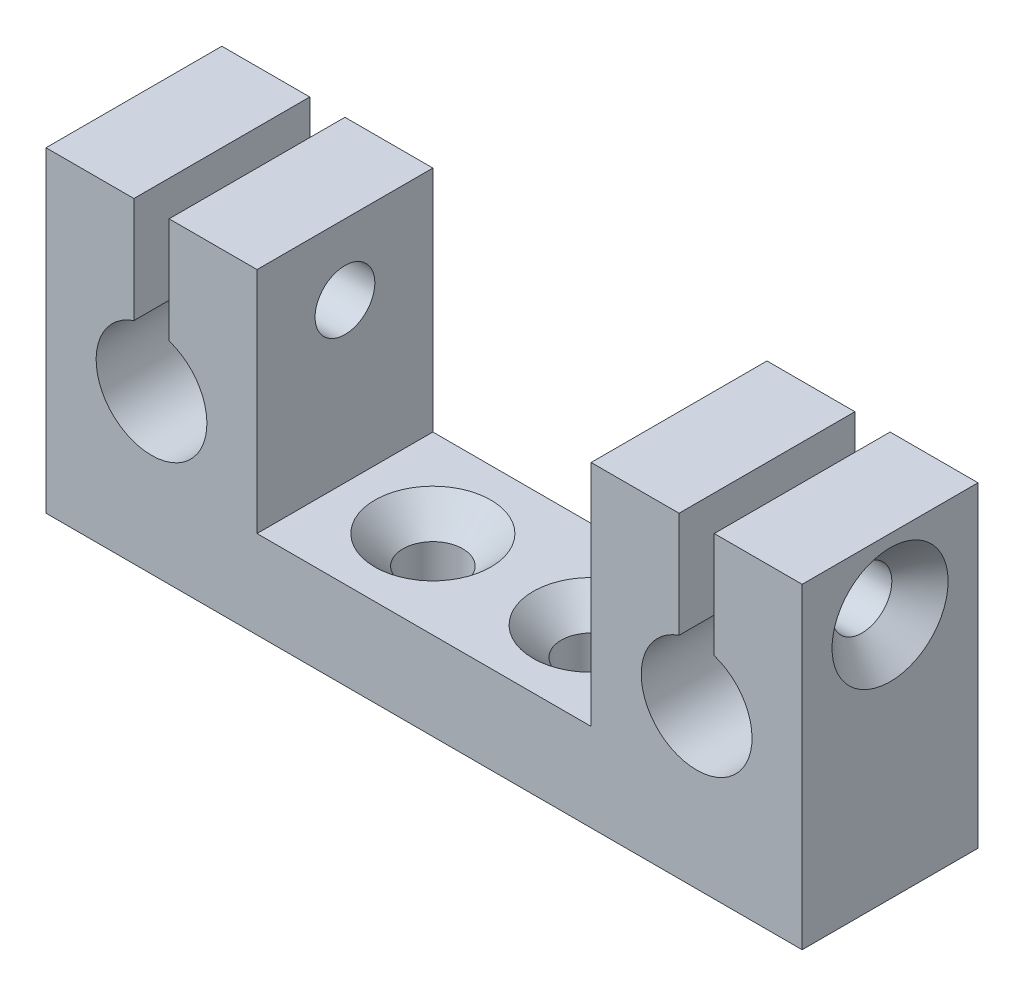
ISO-10303-21;
HEADER;
FILE_DESCRIPTION(('STEP AP214'),'2;1');
FILE_NAME('part.step','',(''),(''),'','','');
FILE_SCHEMA(('AUTOMOTIVE_DESIGN { 1 0 10303 214 1 1 1 1 }'));
ENDSEC;
DATA;
#1=APPLICATION_CONTEXT('core data for automotive mechanical design processes');
#2=APPLICATION_PROTOCOL_DEFINITION('international standard','automotive_design',2000,#1);
#3=PRODUCT_CONTEXT('',#1,'mechanical');
#4=PRODUCT('Part','Part','',(#3));
#5=PRODUCT_RELATED_PRODUCT_CATEGORY('part','',(#4));
#6=PRODUCT_DEFINITION_FORMATION('','',#4);
#7=PRODUCT_DEFINITION_CONTEXT('part definition',#1,'design');
#8=PRODUCT_DEFINITION('design','',#6,#7);
#9=PRODUCT_DEFINITION_SHAPE('','',#8);
#10=(LENGTH_UNIT() NAMED_UNIT(*) SI_UNIT(.MILLI.,.METRE.));
#11=(NAMED_UNIT(*) PLANE_ANGLE_UNIT() SI_UNIT($,.RADIAN.));
#12=(NAMED_UNIT(*) SI_UNIT($,.STERADIAN.) SOLID_ANGLE_UNIT());
#13=UNCERTAINTY_MEASURE_WITH_UNIT(LENGTH_MEASURE(1.E-05),#10,'distance_accuracy_value','');
#14=(GEOMETRIC_REPRESENTATION_CONTEXT(3) GLOBAL_UNCERTAINTY_ASSIGNED_CONTEXT((#13)) GLOBAL_UNIT_ASSIGNED_CONTEXT((#10,
#11,#12)) REPRESENTATION_CONTEXT('',''));
#15=CARTESIAN_POINT('',(0.,0.,0.));
#16=DIRECTION('',(0.,0.,1.));
#17=DIRECTION('',(1.,0.,0.));
#18=AXIS2_PLACEMENT_3D('',#15,#16,#17);
#19=CARTESIAN_POINT('',(0.,-2.5,10.));
#20=DIRECTION('',(0.,1.,0.));
#21=DIRECTION('',(0.,0.,1.));
#22=AXIS2_PLACEMENT_3D('',#19,#20,#21);
#23=PLANE('',#22);
#24=CARTESIAN_POINT('',(-4.49999999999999,-2.5,5.));
#25=DIRECTION('',(0.,1.,0.));
#26=DIRECTION('',(0.,0.,1.));
#27=AXIS2_PLACEMENT_3D('',#24,#25,#26);
#28=CIRCLE('',#27,1.7);
#29=CARTESIAN_POINT('',(-4.49999999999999,-2.5,6.7));
#30=VERTEX_POINT('',#29);
#31=EDGE_CURVE('E49',#30,#30,#28,.T.);
#32=ORIENTED_EDGE('',*,*,#31,.T.);
#33=EDGE_LOOP('',(#32));
#34=FACE_BOUND('',#33,.T.);
#35=CARTESIAN_POINT('',(4.5,-2.5,5.));
#36=DIRECTION('',(0.,1.,0.));
#37=DIRECTION('',(0.,0.,1.));
#38=AXIS2_PLACEMENT_3D('',#35,#36,#37);
#39=CIRCLE('',#38,1.7);
#40=CARTESIAN_POINT('',(4.5,-2.5,6.7));
#41=VERTEX_POINT('',#40);
#42=EDGE_CURVE('E226',#41,#41,#39,.T.);
#43=ORIENTED_EDGE('',*,*,#42,.T.);
#44=EDGE_LOOP('',(#43));
#45=FACE_BOUND('',#44,.T.);
#46=DIRECTION('',(0.,0.,-1.));
#47=VECTOR('',#46,1.);
#48=CARTESIAN_POINT('',(21.5,-2.5,10.));
#49=LINE('',#48,#47);
#50=CARTESIAN_POINT('',(21.5,-2.5,10.));
#51=VERTEX_POINT('',#50);
#52=CARTESIAN_POINT('',(21.5,-2.5,0.));
#53=VERTEX_POINT('',#52);
#54=EDGE_CURVE('E172',#51,#53,#49,.T.);
#55=ORIENTED_EDGE('',*,*,#54,.F.);
#56=DIRECTION('',(1.,0.,0.));
#57=VECTOR('',#56,1.);
#58=CARTESIAN_POINT('',(0.,-2.5,10.));
#59=LINE('',#58,#57);
#60=CARTESIAN_POINT('',(-21.5,-2.5,10.));
#61=VERTEX_POINT('',#60);
#62=EDGE_CURVE('E307',#61,#51,#59,.T.);
#63=ORIENTED_EDGE('',*,*,#62,.F.);
#64=DIRECTION('',(0.,0.,1.));
#65=VECTOR('',#64,1.);
#66=CARTESIAN_POINT('',(-21.5,-2.5,0.));
#67=LINE('',#66,#65);
#68=CARTESIAN_POINT('',(-21.5,-2.5,0.));
#69=VERTEX_POINT('',#68);
#70=EDGE_CURVE('E179',#69,#61,#67,.T.);
#71=ORIENTED_EDGE('',*,*,#70,.F.);
#72=DIRECTION('',(1.,0.,0.));
#73=VECTOR('',#72,1.);
#74=CARTESIAN_POINT('',(0.,-2.5,0.));
#75=LINE('',#74,#73);
#76=EDGE_CURVE('E164',#69,#53,#75,.T.);
#77=ORIENTED_EDGE('',*,*,#76,.T.);
#78=EDGE_LOOP('',(#55,#63,#71,#77));
#79=FACE_BOUND('',#78,.T.);
#80=ADVANCED_FACE('F45',(#34,#45,#79),#23,.F.);
#81=CARTESIAN_POINT('',(0.,0.,10.));
#82=DIRECTION('',(0.,0.,1.));
#83=DIRECTION('',(1.,0.,0.));
#84=AXIS2_PLACEMENT_3D('',#81,#82,#83);
#85=PLANE('',#84);
#86=ORIENTED_EDGE('',*,*,#62,.T.);
#87=DIRECTION('',(0.,-1.,0.));
#88=VECTOR('',#87,1.);
#89=CARTESIAN_POINT('',(21.5,0.,10.));
#90=LINE('',#89,#88);
#91=CARTESIAN_POINT('',(21.5,15.5,10.));
#92=VERTEX_POINT('',#91);
#93=EDGE_CURVE('E175',#92,#51,#90,.T.);
#94=ORIENTED_EDGE('',*,*,#93,.F.);
#95=DIRECTION('',(1.,0.,0.));
#96=VECTOR('',#95,1.);
#97=CARTESIAN_POINT('',(0.,15.5,10.));
#98=LINE('',#97,#96);
#99=CARTESIAN_POINT('',(16.5,15.5,10.));
#100=VERTEX_POINT('',#99);
#101=EDGE_CURVE('E313',#100,#92,#98,.T.);
#102=ORIENTED_EDGE('',*,*,#101,.F.);
#103=DIRECTION('',(0.,1.,0.));
#104=VECTOR('',#103,1.);
#105=CARTESIAN_POINT('',(16.5,17.5112149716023,10.));
#106=LINE('',#105,#104);
#107=CARTESIAN_POINT('',(16.5,9.48705540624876,10.));
#108=VERTEX_POINT('',#107);
#109=EDGE_CURVE('E271',#108,#100,#106,.T.);
#110=ORIENTED_EDGE('',*,*,#109,.F.);
#111=CARTESIAN_POINT('',(15.5,6.5,10.));
#112=DIRECTION('',(0.,0.,1.));
#113=DIRECTION('',(1.,0.,0.));
#114=AXIS2_PLACEMENT_3D('',#111,#112,#113);
#115=CIRCLE('',#114,3.14999999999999);
#116=CARTESIAN_POINT('',(14.5,9.48705540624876,10.));
#117=VERTEX_POINT('',#116);
#118=EDGE_CURVE('E293',#117,#108,#115,.T.);
#119=ORIENTED_EDGE('',*,*,#118,.F.);
#120=DIRECTION('',(0.,-1.,0.));
#121=VECTOR('',#120,1.);
#122=CARTESIAN_POINT('',(14.5,17.5112149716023,10.));
#123=LINE('',#122,#121);
#124=CARTESIAN_POINT('',(14.5,15.5,10.));
#125=VERTEX_POINT('',#124);
#126=EDGE_CURVE('E62',#125,#117,#123,.T.);
#127=ORIENTED_EDGE('',*,*,#126,.F.);
#128=CARTESIAN_POINT('',(9.5,15.5,10.));
#129=VERTEX_POINT('',#128);
#130=EDGE_CURVE('E314',#129,#125,#98,.T.);
#131=ORIENTED_EDGE('',*,*,#130,.F.);
#132=DIRECTION('',(0.,-1.,0.));
#133=VECTOR('',#132,1.);
#134=CARTESIAN_POINT('',(9.5,0.,10.));
#135=LINE('',#134,#133);
#136=CARTESIAN_POINT('',(9.5,2.5,10.));
#137=VERTEX_POINT('',#136);
#138=EDGE_CURVE('E310',#129,#137,#135,.T.);
#139=ORIENTED_EDGE('',*,*,#138,.T.);
#140=DIRECTION('',(1.,0.,0.));
#141=VECTOR('',#140,1.);
#142=CARTESIAN_POINT('',(0.,2.5,10.));
#143=LINE('',#142,#141);
#144=CARTESIAN_POINT('',(-9.49999999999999,2.5,10.));
#145=VERTEX_POINT('',#144);
#146=EDGE_CURVE('E199',#145,#137,#143,.T.);
#147=ORIENTED_EDGE('',*,*,#146,.F.);
#148=DIRECTION('',(0.,-1.,0.));
#149=VECTOR('',#148,1.);
#150=CARTESIAN_POINT('',(-9.49999999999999,0.,10.));
#151=LINE('',#150,#149);
#152=CARTESIAN_POINT('',(-9.49999999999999,15.5,10.));
#153=VERTEX_POINT('',#152);
#154=EDGE_CURVE('E298',#153,#145,#151,.T.);
#155=ORIENTED_EDGE('',*,*,#154,.F.);
#156=DIRECTION('',(1.,0.,0.));
#157=VECTOR('',#156,1.);
#158=CARTESIAN_POINT('',(0.,15.5,10.));
#159=LINE('',#158,#157);
#160=CARTESIAN_POINT('',(-14.5,15.5,10.));
#161=VERTEX_POINT('',#160);
#162=EDGE_CURVE('E301',#161,#153,#159,.T.);
#163=ORIENTED_EDGE('',*,*,#162,.F.);
#164=DIRECTION('',(0.,1.,0.));
#165=VECTOR('',#164,1.);
#166=CARTESIAN_POINT('',(-14.5,16.9536585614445,10.));
#167=LINE('',#166,#165);
#168=CARTESIAN_POINT('',(-14.5,9.48705540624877,10.));
#169=VERTEX_POINT('',#168);
#170=EDGE_CURVE('E264',#169,#161,#167,.T.);
#171=ORIENTED_EDGE('',*,*,#170,.F.);
#172=CARTESIAN_POINT('',(-15.5,6.50000000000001,10.));
#173=DIRECTION('',(0.,0.,1.));
#174=DIRECTION('',(1.,0.,0.));
#175=AXIS2_PLACEMENT_3D('',#172,#173,#174);
#176=CIRCLE('',#175,3.15);
#177=CARTESIAN_POINT('',(-16.5,9.48705540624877,10.));
#178=VERTEX_POINT('',#177);
#179=EDGE_CURVE('E290',#178,#169,#176,.T.);
#180=ORIENTED_EDGE('',*,*,#179,.F.);
#181=DIRECTION('',(0.,-1.,0.));
#182=VECTOR('',#181,1.);
#183=CARTESIAN_POINT('',(-16.5,16.9536585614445,10.));
#184=LINE('',#183,#182);
#185=CARTESIAN_POINT('',(-16.5,15.5,10.));
#186=VERTEX_POINT('',#185);
#187=EDGE_CURVE('E268',#186,#178,#184,.T.);
#188=ORIENTED_EDGE('',*,*,#187,.F.);
#189=CARTESIAN_POINT('',(-21.5,15.5,10.));
#190=VERTEX_POINT('',#189);
#191=EDGE_CURVE('E302',#190,#186,#159,.T.);
#192=ORIENTED_EDGE('',*,*,#191,.F.);
#193=DIRECTION('',(0.,-1.,0.));
#194=VECTOR('',#193,1.);
#195=CARTESIAN_POINT('',(-21.5,0.,10.));
#196=LINE('',#195,#194);
#197=EDGE_CURVE('E305',#190,#61,#196,.T.);
#198=ORIENTED_EDGE('',*,*,#197,.T.);
#199=EDGE_LOOP('',(#86,#94,#102,#110,#119,#127,#131,#139,#147,#155,#163,#171,#180,#188,#192,#198));
#200=FACE_BOUND('',#199,.T.);
#201=ADVANCED_FACE('F349',(#200),#85,.T.);
#202=CARTESIAN_POINT('',(0.,0.,0.));
#203=DIRECTION('',(0.,0.,1.));
#204=DIRECTION('',(1.,0.,0.));
#205=AXIS2_PLACEMENT_3D('',#202,#203,#204);
#206=PLANE('',#205);
#207=DIRECTION('',(0.,-1.,0.));
#208=VECTOR('',#207,1.);
#209=CARTESIAN_POINT('',(21.5,0.,0.));
#210=LINE('',#209,#208);
#211=CARTESIAN_POINT('',(21.5,15.5,0.));
#212=VERTEX_POINT('',#211);
#213=EDGE_CURVE('E159',#212,#53,#210,.T.);
#214=ORIENTED_EDGE('',*,*,#213,.T.);
#215=ORIENTED_EDGE('',*,*,#76,.F.);
#216=DIRECTION('',(0.,-1.,0.));
#217=VECTOR('',#216,1.);
#218=CARTESIAN_POINT('',(-21.5,0.,0.));
#219=LINE('',#218,#217);
#220=CARTESIAN_POINT('',(-21.5,15.5,0.));
#221=VERTEX_POINT('',#220);
#222=EDGE_CURVE('E183',#221,#69,#219,.T.);
#223=ORIENTED_EDGE('',*,*,#222,.F.);
#224=DIRECTION('',(1.,0.,0.));
#225=VECTOR('',#224,1.);
#226=CARTESIAN_POINT('',(0.,15.5,0.));
#227=LINE('',#226,#225);
#228=CARTESIAN_POINT('',(-16.5,15.5,0.));
#229=VERTEX_POINT('',#228);
#230=EDGE_CURVE('E185',#221,#229,#227,.T.);
#231=ORIENTED_EDGE('',*,*,#230,.T.);
#232=DIRECTION('',(0.,-1.,0.));
#233=VECTOR('',#232,1.);
#234=CARTESIAN_POINT('',(-16.5,16.9536585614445,0.));
#235=LINE('',#234,#233);
#236=CARTESIAN_POINT('',(-16.5,9.48705540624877,0.));
#237=VERTEX_POINT('',#236);
#238=EDGE_CURVE('E260',#229,#237,#235,.T.);
#239=ORIENTED_EDGE('',*,*,#238,.T.);
#240=CARTESIAN_POINT('',(-15.5,6.50000000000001,0.));
#241=DIRECTION('',(0.,0.,1.));
#242=DIRECTION('',(1.,0.,0.));
#243=AXIS2_PLACEMENT_3D('',#240,#241,#242);
#244=CIRCLE('',#243,3.15);
#245=CARTESIAN_POINT('',(-14.5,9.48705540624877,0.));
#246=VERTEX_POINT('',#245);
#247=EDGE_CURVE('E286',#237,#246,#244,.T.);
#248=ORIENTED_EDGE('',*,*,#247,.T.);
#249=DIRECTION('',(0.,1.,0.));
#250=VECTOR('',#249,1.);
#251=CARTESIAN_POINT('',(-14.5,16.9536585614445,0.));
#252=LINE('',#251,#250);
#253=CARTESIAN_POINT('',(-14.5,15.5,0.));
#254=VERTEX_POINT('',#253);
#255=EDGE_CURVE('E263',#246,#254,#252,.T.);
#256=ORIENTED_EDGE('',*,*,#255,.T.);
#257=CARTESIAN_POINT('',(-9.49999999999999,15.5,0.));
#258=VERTEX_POINT('',#257);
#259=EDGE_CURVE('E320',#254,#258,#227,.T.);
#260=ORIENTED_EDGE('',*,*,#259,.T.);
#261=DIRECTION('',(0.,-1.,0.));
#262=VECTOR('',#261,1.);
#263=CARTESIAN_POINT('',(-9.49999999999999,0.,0.));
#264=LINE('',#263,#262);
#265=CARTESIAN_POINT('',(-9.49999999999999,2.5,0.));
#266=VERTEX_POINT('',#265);
#267=EDGE_CURVE('E289',#258,#266,#264,.T.);
#268=ORIENTED_EDGE('',*,*,#267,.T.);
#269=DIRECTION('',(1.,0.,0.));
#270=VECTOR('',#269,1.);
#271=CARTESIAN_POINT('',(0.,2.5,0.));
#272=LINE('',#271,#270);
#273=CARTESIAN_POINT('',(9.5,2.5,0.));
#274=VERTEX_POINT('',#273);
#275=EDGE_CURVE('E188',#266,#274,#272,.T.);
#276=ORIENTED_EDGE('',*,*,#275,.T.);
#277=DIRECTION('',(0.,-1.,0.));
#278=VECTOR('',#277,1.);
#279=CARTESIAN_POINT('',(9.5,0.,0.));
#280=LINE('',#279,#278);
#281=CARTESIAN_POINT('',(9.5,15.5,0.));
#282=VERTEX_POINT('',#281);
#283=EDGE_CURVE('E193',#282,#274,#280,.T.);
#284=ORIENTED_EDGE('',*,*,#283,.F.);
#285=DIRECTION('',(1.,0.,0.));
#286=VECTOR('',#285,1.);
#287=CARTESIAN_POINT('',(0.,15.5,0.));
#288=LINE('',#287,#286);
#289=CARTESIAN_POINT('',(14.5,15.5,0.));
#290=VERTEX_POINT('',#289);
#291=EDGE_CURVE('E190',#282,#290,#288,.T.);
#292=ORIENTED_EDGE('',*,*,#291,.T.);
#293=DIRECTION('',(0.,-1.,0.));
#294=VECTOR('',#293,1.);
#295=CARTESIAN_POINT('',(14.5,17.5112149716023,0.));
#296=LINE('',#295,#294);
#297=CARTESIAN_POINT('',(14.5,9.48705540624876,0.));
#298=VERTEX_POINT('',#297);
#299=EDGE_CURVE('E273',#290,#298,#296,.T.);
#300=ORIENTED_EDGE('',*,*,#299,.T.);
#301=CARTESIAN_POINT('',(15.5,6.5,0.));
#302=DIRECTION('',(0.,0.,1.));
#303=DIRECTION('',(1.,0.,0.));
#304=AXIS2_PLACEMENT_3D('',#301,#302,#303);
#305=CIRCLE('',#304,3.14999999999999);
#306=CARTESIAN_POINT('',(16.5,9.48705540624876,0.));
#307=VERTEX_POINT('',#306);
#308=EDGE_CURVE('E285',#298,#307,#305,.T.);
#309=ORIENTED_EDGE('',*,*,#308,.T.);
#310=DIRECTION('',(0.,1.,0.));
#311=VECTOR('',#310,1.);
#312=CARTESIAN_POINT('',(16.5,17.5112149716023,0.));
#313=LINE('',#312,#311);
#314=CARTESIAN_POINT('',(16.5,15.5,0.));
#315=VERTEX_POINT('',#314);
#316=EDGE_CURVE('E69',#307,#315,#313,.T.);
#317=ORIENTED_EDGE('',*,*,#316,.T.);
#318=EDGE_CURVE('E166',#315,#212,#288,.T.);
#319=ORIENTED_EDGE('',*,*,#318,.T.);
#320=EDGE_LOOP('',(#214,#215,#223,#231,#239,#248,#256,#260,#268,#276,#284,#292,#300,#309,#317,#319));
#321=FACE_BOUND('',#320,.T.);
#322=ADVANCED_FACE('F161',(#321),#206,.F.);
#323=CARTESIAN_POINT('',(0.,15.5,10.));
#324=DIRECTION('',(0.,1.,0.));
#325=DIRECTION('',(-1.,0.,0.));
#326=AXIS2_PLACEMENT_3D('',#323,#324,#325);
#327=PLANE('',#326);
#328=DIRECTION('',(0.,0.,1.));
#329=VECTOR('',#328,1.);
#330=CARTESIAN_POINT('',(-16.5,15.5,10.));
#331=LINE('',#330,#329);
#332=EDGE_CURVE('E279',#229,#186,#331,.T.);
#333=ORIENTED_EDGE('',*,*,#332,.F.);
#334=ORIENTED_EDGE('',*,*,#230,.F.);
#335=DIRECTION('',(0.,0.,-1.));
#336=VECTOR('',#335,1.);
#337=CARTESIAN_POINT('',(-21.5,15.5,10.));
#338=LINE('',#337,#336);
#339=EDGE_CURVE('E205',#190,#221,#338,.T.);
#340=ORIENTED_EDGE('',*,*,#339,.F.);
#341=ORIENTED_EDGE('',*,*,#191,.T.);
#342=EDGE_LOOP('',(#333,#334,#340,#341));
#343=FACE_BOUND('',#342,.T.);
#344=ADVANCED_FACE('F401',(#343),#327,.T.);
#345=CARTESIAN_POINT('',(0.,15.5,10.));
#346=DIRECTION('',(0.,1.,0.));
#347=DIRECTION('',(-1.,0.,0.));
#348=AXIS2_PLACEMENT_3D('',#345,#346,#347);
#349=PLANE('',#348);
#350=DIRECTION('',(0.,0.,1.));
#351=VECTOR('',#350,1.);
#352=CARTESIAN_POINT('',(14.5,15.5,10.));
#353=LINE('',#352,#351);
#354=EDGE_CURVE('E283',#290,#125,#353,.T.);
#355=ORIENTED_EDGE('',*,*,#354,.F.);
#356=ORIENTED_EDGE('',*,*,#291,.F.);
#357=DIRECTION('',(0.,0.,-1.));
#358=VECTOR('',#357,1.);
#359=CARTESIAN_POINT('',(9.5,15.5,10.));
#360=LINE('',#359,#358);
#361=EDGE_CURVE('E201',#129,#282,#360,.T.);
#362=ORIENTED_EDGE('',*,*,#361,.F.);
#363=ORIENTED_EDGE('',*,*,#130,.T.);
#364=EDGE_LOOP('',(#355,#356,#362,#363));
#365=FACE_BOUND('',#364,.T.);
#366=ADVANCED_FACE('F343',(#365),#349,.T.);
#367=CARTESIAN_POINT('',(-9.49999999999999,0.,10.));
#368=DIRECTION('',(1.,0.,0.));
#369=DIRECTION('',(0.,1.,0.));
#370=AXIS2_PLACEMENT_3D('',#367,#368,#369);
#371=PLANE('',#370);
#372=CARTESIAN_POINT('',(-9.49999999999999,11.5,5.));
#373=DIRECTION('',(1.,0.,0.));
#374=DIRECTION('',(0.,1.,0.));
#375=AXIS2_PLACEMENT_3D('',#372,#373,#374);
#376=CIRCLE('',#375,1.69999999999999);
#377=CARTESIAN_POINT('',(-9.49999999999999,13.2,5.));
#378=VERTEX_POINT('',#377);
#379=EDGE_CURVE('E257',#378,#378,#376,.T.);
#380=ORIENTED_EDGE('',*,*,#379,.F.);
#381=EDGE_LOOP('',(#380));
#382=FACE_BOUND('',#381,.T.);
#383=ORIENTED_EDGE('',*,*,#267,.F.);
#384=DIRECTION('',(0.,0.,-1.));
#385=VECTOR('',#384,1.);
#386=CARTESIAN_POINT('',(-9.49999999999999,15.5,10.));
#387=LINE('',#386,#385);
#388=EDGE_CURVE('E207',#153,#258,#387,.T.);
#389=ORIENTED_EDGE('',*,*,#388,.F.);
#390=ORIENTED_EDGE('',*,*,#154,.T.);
#391=DIRECTION('',(0.,0.,-1.));
#392=VECTOR('',#391,1.);
#393=CARTESIAN_POINT('',(-9.49999999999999,2.5,10.));
#394=LINE('',#393,#392);
#395=EDGE_CURVE('E196',#145,#266,#394,.T.);
#396=ORIENTED_EDGE('',*,*,#395,.T.);
#397=EDGE_LOOP('',(#383,#389,#390,#396));
#398=FACE_BOUND('',#397,.T.);
#399=ADVANCED_FACE('F47',(#382,#398),#371,.T.);
#400=DIRECTION('',(0.,0.,-1.));
#401=VECTOR('',#400,1.);
#402=CARTESIAN_POINT('',(-14.5,15.5,10.));
#403=LINE('',#402,#401);
#404=EDGE_CURVE('E267',#161,#254,#403,.T.);
#405=ORIENTED_EDGE('',*,*,#404,.F.);
#406=ORIENTED_EDGE('',*,*,#162,.T.);
#407=ORIENTED_EDGE('',*,*,#388,.T.);
#408=ORIENTED_EDGE('',*,*,#259,.F.);
#409=EDGE_LOOP('',(#405,#406,#407,#408));
#410=FACE_BOUND('',#409,.T.);
#411=ADVANCED_FACE('F330',(#410),#327,.T.);
#412=CARTESIAN_POINT('',(-21.5,0.,10.));
#413=DIRECTION('',(1.,0.,0.));
#414=DIRECTION('',(0.,0.,-1.));
#415=AXIS2_PLACEMENT_3D('',#412,#413,#414);
#416=PLANE('',#415);
#417=CARTESIAN_POINT('',(-21.5,11.5,5.));
#418=DIRECTION('',(-1.,0.,0.));
#419=DIRECTION('',(0.,0.,1.));
#420=AXIS2_PLACEMENT_3D('',#417,#418,#419);
#421=CIRCLE('',#420,3.3);
#422=CARTESIAN_POINT('',(-21.5,11.5,8.3));
#423=VERTEX_POINT('',#422);
#424=EDGE_CURVE('E250',#423,#423,#421,.T.);
#425=ORIENTED_EDGE('',*,*,#424,.F.);
#426=EDGE_LOOP('',(#425));
#427=FACE_BOUND('',#426,.T.);
#428=ORIENTED_EDGE('',*,*,#222,.T.);
#429=ORIENTED_EDGE('',*,*,#70,.T.);
#430=ORIENTED_EDGE('',*,*,#197,.F.);
#431=ORIENTED_EDGE('',*,*,#339,.T.);
#432=EDGE_LOOP('',(#428,#429,#430,#431));
#433=FACE_BOUND('',#432,.T.);
#434=ADVANCED_FACE('F362',(#427,#433),#416,.F.);
#435=CARTESIAN_POINT('',(21.5,0.,10.));
#436=DIRECTION('',(1.,0.,0.));
#437=DIRECTION('',(0.,1.,0.));
#438=AXIS2_PLACEMENT_3D('',#435,#436,#437);
#439=PLANE('',#438);
#440=CARTESIAN_POINT('',(21.5,11.5,5.));
#441=DIRECTION('',(1.,0.,0.));
#442=DIRECTION('',(0.,0.,-1.));
#443=AXIS2_PLACEMENT_3D('',#440,#441,#442);
#444=CIRCLE('',#443,3.3);
#445=CARTESIAN_POINT('',(21.5,11.5,1.7));
#446=VERTEX_POINT('',#445);
#447=EDGE_CURVE('E228',#446,#446,#444,.T.);
#448=ORIENTED_EDGE('',*,*,#447,.F.);
#449=EDGE_LOOP('',(#448));
#450=FACE_BOUND('',#449,.T.);
#451=ORIENTED_EDGE('',*,*,#213,.F.);
#452=DIRECTION('',(0.,0.,-1.));
#453=VECTOR('',#452,1.);
#454=CARTESIAN_POINT('',(21.5,15.5,10.));
#455=LINE('',#454,#453);
#456=EDGE_CURVE('E203',#92,#212,#455,.T.);
#457=ORIENTED_EDGE('',*,*,#456,.F.);
#458=ORIENTED_EDGE('',*,*,#93,.T.);
#459=ORIENTED_EDGE('',*,*,#54,.T.);
#460=EDGE_LOOP('',(#451,#457,#458,#459));
#461=FACE_BOUND('',#460,.T.);
#462=ADVANCED_FACE('F173',(#450,#461),#439,.T.);
#463=DIRECTION('',(0.,0.,-1.));
#464=VECTOR('',#463,1.);
#465=CARTESIAN_POINT('',(16.5,15.5,10.));
#466=LINE('',#465,#464);
#467=EDGE_CURVE('E281',#100,#315,#466,.T.);
#468=ORIENTED_EDGE('',*,*,#467,.F.);
#469=ORIENTED_EDGE('',*,*,#101,.T.);
#470=ORIENTED_EDGE('',*,*,#456,.T.);
#471=ORIENTED_EDGE('',*,*,#318,.F.);
#472=EDGE_LOOP('',(#468,#469,#470,#471));
#473=FACE_BOUND('',#472,.T.);
#474=ADVANCED_FACE('F357',(#473),#349,.T.);
#475=CARTESIAN_POINT('',(9.5,0.,10.));
#476=DIRECTION('',(1.,0.,0.));
#477=DIRECTION('',(0.,1.,0.));
#478=AXIS2_PLACEMENT_3D('',#475,#476,#477);
#479=PLANE('',#478);
#480=CARTESIAN_POINT('',(9.5,11.5,5.));
#481=DIRECTION('',(1.,0.,0.));
#482=DIRECTION('',(0.,1.,0.));
#483=AXIS2_PLACEMENT_3D('',#480,#481,#482);
#484=CIRCLE('',#483,1.69999999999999);
#485=CARTESIAN_POINT('',(9.5,13.2,5.));
#486=VERTEX_POINT('',#485);
#487=EDGE_CURVE('E247',#486,#486,#484,.T.);
#488=ORIENTED_EDGE('',*,*,#487,.T.);
#489=EDGE_LOOP('',(#488));
#490=FACE_BOUND('',#489,.T.);
#491=ORIENTED_EDGE('',*,*,#283,.T.);
#492=DIRECTION('',(0.,0.,-1.));
#493=VECTOR('',#492,1.);
#494=CARTESIAN_POINT('',(9.5,2.5,10.));
#495=LINE('',#494,#493);
#496=EDGE_CURVE('E198',#137,#274,#495,.T.);
#497=ORIENTED_EDGE('',*,*,#496,.F.);
#498=ORIENTED_EDGE('',*,*,#138,.F.);
#499=ORIENTED_EDGE('',*,*,#361,.T.);
#500=EDGE_LOOP('',(#491,#497,#498,#499));
#501=FACE_BOUND('',#500,.T.);
#502=ADVANCED_FACE('F423',(#490,#501),#479,.F.);
#503=CARTESIAN_POINT('',(0.,2.5,10.));
#504=DIRECTION('',(0.,1.,0.));
#505=DIRECTION('',(0.,0.,1.));
#506=AXIS2_PLACEMENT_3D('',#503,#504,#505);
#507=PLANE('',#506);
#508=CARTESIAN_POINT('',(-4.49999999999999,2.5,5.));
#509=DIRECTION('',(0.,1.,0.));
#510=DIRECTION('',(0.,0.,1.));
#511=AXIS2_PLACEMENT_3D('',#508,#509,#510);
#512=CIRCLE('',#511,3.3);
#513=CARTESIAN_POINT('',(-4.49999999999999,2.5,8.3));
#514=VERTEX_POINT('',#513);
#515=EDGE_CURVE('E363',#514,#514,#512,.T.);
#516=ORIENTED_EDGE('',*,*,#515,.F.);
#517=EDGE_LOOP('',(#516));
#518=FACE_BOUND('',#517,.T.);
#519=CARTESIAN_POINT('',(4.5,2.5,5.));
#520=DIRECTION('',(0.,1.,0.));
#521=DIRECTION('',(0.,0.,1.));
#522=AXIS2_PLACEMENT_3D('',#519,#520,#521);
#523=CIRCLE('',#522,3.3);
#524=CARTESIAN_POINT('',(4.5,2.5,8.3));
#525=VERTEX_POINT('',#524);
#526=EDGE_CURVE('E235',#525,#525,#523,.T.);
#527=ORIENTED_EDGE('',*,*,#526,.F.);
#528=EDGE_LOOP('',(#527));
#529=FACE_BOUND('',#528,.T.);
#530=ORIENTED_EDGE('',*,*,#275,.F.);
#531=ORIENTED_EDGE('',*,*,#395,.F.);
#532=ORIENTED_EDGE('',*,*,#146,.T.);
#533=ORIENTED_EDGE('',*,*,#496,.T.);
#534=EDGE_LOOP('',(#530,#531,#532,#533));
#535=FACE_BOUND('',#534,.T.);
#536=ADVANCED_FACE('F336',(#518,#529,#535),#507,.T.);
#537=CARTESIAN_POINT('',(15.5,6.5,0.));
#538=DIRECTION('',(0.,0.,1.));
#539=DIRECTION('',(1.,0.,0.));
#540=AXIS2_PLACEMENT_3D('',#537,#538,#539);
#541=CYLINDRICAL_SURFACE('',#540,3.14999999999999);
#542=ORIENTED_EDGE('',*,*,#308,.F.);
#543=DIRECTION('',(0.,0.,1.));
#544=VECTOR('',#543,1.);
#545=CARTESIAN_POINT('',(14.5,9.48705540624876,0.));
#546=LINE('',#545,#544);
#547=EDGE_CURVE('E11',#298,#117,#546,.T.);
#548=ORIENTED_EDGE('',*,*,#547,.T.);
#549=ORIENTED_EDGE('',*,*,#118,.T.);
#550=DIRECTION('',(0.,0.,1.));
#551=VECTOR('',#550,1.);
#552=CARTESIAN_POINT('',(16.5,9.48705540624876,0.));
#553=LINE('',#552,#551);
#554=EDGE_CURVE('E54',#108,#307,#553,.F.);
#555=ORIENTED_EDGE('',*,*,#554,.T.);
#556=EDGE_LOOP('',(#542,#548,#549,#555));
#557=FACE_BOUND('',#556,.T.);
#558=ADVANCED_FACE('F354',(#557),#541,.F.);
#559=CARTESIAN_POINT('',(-15.5,6.50000000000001,0.));
#560=DIRECTION('',(0.,0.,1.));
#561=DIRECTION('',(1.,0.,0.));
#562=AXIS2_PLACEMENT_3D('',#559,#560,#561);
#563=CYLINDRICAL_SURFACE('',#562,3.15);
#564=ORIENTED_EDGE('',*,*,#247,.F.);
#565=DIRECTION('',(0.,0.,1.));
#566=VECTOR('',#565,1.);
#567=CARTESIAN_POINT('',(-16.5,9.48705540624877,0.));
#568=LINE('',#567,#566);
#569=EDGE_CURVE('E213',#237,#178,#568,.T.);
#570=ORIENTED_EDGE('',*,*,#569,.T.);
#571=ORIENTED_EDGE('',*,*,#179,.T.);
#572=DIRECTION('',(0.,0.,1.));
#573=VECTOR('',#572,1.);
#574=CARTESIAN_POINT('',(-14.5,9.48705540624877,0.));
#575=LINE('',#574,#573);
#576=EDGE_CURVE('E210',#169,#246,#575,.F.);
#577=ORIENTED_EDGE('',*,*,#576,.T.);
#578=EDGE_LOOP('',(#564,#570,#571,#577));
#579=FACE_BOUND('',#578,.T.);
#580=ADVANCED_FACE('F420',(#579),#563,.F.);
#581=CARTESIAN_POINT('',(-14.5,16.9536585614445,0.));
#582=DIRECTION('',(1.,0.,0.));
#583=DIRECTION('',(0.,1.,0.));
#584=AXIS2_PLACEMENT_3D('',#581,#582,#583);
#585=PLANE('',#584);
#586=CARTESIAN_POINT('',(-14.5,11.5,5.));
#587=DIRECTION('',(1.,0.,0.));
#588=DIRECTION('',(0.,1.,0.));
#589=AXIS2_PLACEMENT_3D('',#586,#587,#588);
#590=CIRCLE('',#589,1.69999999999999);
#591=CARTESIAN_POINT('',(-14.5,13.2,5.));
#592=VERTEX_POINT('',#591);
#593=EDGE_CURVE('E220',#592,#592,#590,.T.);
#594=ORIENTED_EDGE('',*,*,#593,.T.);
#595=EDGE_LOOP('',(#594));
#596=FACE_BOUND('',#595,.T.);
#597=ORIENTED_EDGE('',*,*,#404,.T.);
#598=ORIENTED_EDGE('',*,*,#255,.F.);
#599=ORIENTED_EDGE('',*,*,#576,.F.);
#600=ORIENTED_EDGE('',*,*,#170,.T.);
#601=EDGE_LOOP('',(#597,#598,#599,#600));
#602=FACE_BOUND('',#601,.T.);
#603=ADVANCED_FACE('F422',(#596,#602),#585,.F.);
#604=CARTESIAN_POINT('',(-16.5,16.9536585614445,0.));
#605=DIRECTION('',(-1.,0.,0.));
#606=DIRECTION('',(0.,0.,1.));
#607=AXIS2_PLACEMENT_3D('',#604,#605,#606);
#608=PLANE('',#607);
#609=CARTESIAN_POINT('',(-16.5,11.5,5.));
#610=DIRECTION('',(-1.,0.,0.));
#611=DIRECTION('',(0.,0.,1.));
#612=AXIS2_PLACEMENT_3D('',#609,#610,#611);
#613=CIRCLE('',#612,1.69999999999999);
#614=CARTESIAN_POINT('',(-16.5,11.5,6.69999999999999));
#615=VERTEX_POINT('',#614);
#616=EDGE_CURVE('E217',#615,#615,#613,.T.);
#617=ORIENTED_EDGE('',*,*,#616,.T.);
#618=EDGE_LOOP('',(#617));
#619=FACE_BOUND('',#618,.T.);
#620=ORIENTED_EDGE('',*,*,#332,.T.);
#621=ORIENTED_EDGE('',*,*,#187,.T.);
#622=ORIENTED_EDGE('',*,*,#569,.F.);
#623=ORIENTED_EDGE('',*,*,#238,.F.);
#624=EDGE_LOOP('',(#620,#621,#622,#623));
#625=FACE_BOUND('',#624,.T.);
#626=ADVANCED_FACE('F415',(#619,#625),#608,.F.);
#627=CARTESIAN_POINT('',(16.5,17.5112149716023,0.));
#628=DIRECTION('',(1.,0.,0.));
#629=DIRECTION('',(0.,0.,-1.));
#630=AXIS2_PLACEMENT_3D('',#627,#628,#629);
#631=PLANE('',#630);
#632=CARTESIAN_POINT('',(16.5,11.5,5.));
#633=DIRECTION('',(1.,0.,0.));
#634=DIRECTION('',(0.,0.,-1.));
#635=AXIS2_PLACEMENT_3D('',#632,#633,#634);
#636=CIRCLE('',#635,1.69999999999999);
#637=CARTESIAN_POINT('',(16.5,11.5,3.30000000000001));
#638=VERTEX_POINT('',#637);
#639=EDGE_CURVE('E224',#638,#638,#636,.T.);
#640=ORIENTED_EDGE('',*,*,#639,.T.);
#641=EDGE_LOOP('',(#640));
#642=FACE_BOUND('',#641,.T.);
#643=ORIENTED_EDGE('',*,*,#467,.T.);
#644=ORIENTED_EDGE('',*,*,#316,.F.);
#645=ORIENTED_EDGE('',*,*,#554,.F.);
#646=ORIENTED_EDGE('',*,*,#109,.T.);
#647=EDGE_LOOP('',(#643,#644,#645,#646));
#648=FACE_BOUND('',#647,.T.);
#649=ADVANCED_FACE('F438',(#642,#648),#631,.F.);
#650=CARTESIAN_POINT('',(14.5,17.5112149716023,0.));
#651=DIRECTION('',(-1.,0.,0.));
#652=DIRECTION('',(0.,-1.,0.));
#653=AXIS2_PLACEMENT_3D('',#650,#651,#652);
#654=PLANE('',#653);
#655=CARTESIAN_POINT('',(14.5,11.5,5.));
#656=DIRECTION('',(-1.,0.,0.));
#657=DIRECTION('',(0.,-1.,0.));
#658=AXIS2_PLACEMENT_3D('',#655,#656,#657);
#659=CIRCLE('',#658,1.69999999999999);
#660=CARTESIAN_POINT('',(14.5,9.80000000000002,5.));
#661=VERTEX_POINT('',#660);
#662=EDGE_CURVE('E222',#661,#661,#659,.T.);
#663=ORIENTED_EDGE('',*,*,#662,.T.);
#664=EDGE_LOOP('',(#663));
#665=FACE_BOUND('',#664,.T.);
#666=ORIENTED_EDGE('',*,*,#354,.T.);
#667=ORIENTED_EDGE('',*,*,#126,.T.);
#668=ORIENTED_EDGE('',*,*,#547,.F.);
#669=ORIENTED_EDGE('',*,*,#299,.F.);
#670=EDGE_LOOP('',(#666,#667,#668,#669));
#671=FACE_BOUND('',#670,.T.);
#672=ADVANCED_FACE('F346',(#665,#671),#654,.F.);
#673=CARTESIAN_POINT('',(-21.5,11.5,5.));
#674=DIRECTION('',(-1.,0.,0.));
#675=DIRECTION('',(0.,0.,1.));
#676=AXIS2_PLACEMENT_3D('',#673,#674,#675);
#677=CYLINDRICAL_SURFACE('',#676,1.69999999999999);
#678=CARTESIAN_POINT('',(-19.9,11.5,5.));
#679=DIRECTION('',(-1.,0.,0.));
#680=DIRECTION('',(0.,0.,1.));
#681=AXIS2_PLACEMENT_3D('',#678,#679,#680);
#682=CIRCLE('',#681,1.69999999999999);
#683=CARTESIAN_POINT('',(-19.9,11.5,6.69999999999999));
#684=VERTEX_POINT('',#683);
#685=EDGE_CURVE('E221',#684,#684,#682,.T.);
#686=ORIENTED_EDGE('',*,*,#685,.T.);
#687=EDGE_LOOP('',(#686));
#688=FACE_BOUND('',#687,.T.);
#689=ORIENTED_EDGE('',*,*,#616,.F.);
#690=EDGE_LOOP('',(#689));
#691=FACE_BOUND('',#690,.T.);
#692=ADVANCED_FACE('F444',(#688,#691),#677,.F.);
#693=CARTESIAN_POINT('',(-21.5,11.5,5.));
#694=DIRECTION('',(-1.,0.,0.));
#695=DIRECTION('',(0.,0.,1.));
#696=AXIS2_PLACEMENT_3D('',#693,#694,#695);
#697=CONICAL_SURFACE('',#696,3.3,0.78539816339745);
#698=ORIENTED_EDGE('',*,*,#685,.F.);
#699=EDGE_LOOP('',(#698));
#700=FACE_BOUND('',#699,.T.);
#701=ORIENTED_EDGE('',*,*,#424,.T.);
#702=EDGE_LOOP('',(#701));
#703=FACE_BOUND('',#702,.T.);
#704=ADVANCED_FACE('F456',(#700,#703),#697,.F.);
#705=ORIENTED_EDGE('',*,*,#379,.T.);
#706=EDGE_LOOP('',(#705));
#707=FACE_BOUND('',#706,.T.);
#708=ORIENTED_EDGE('',*,*,#593,.F.);
#709=EDGE_LOOP('',(#708));
#710=FACE_BOUND('',#709,.T.);
#711=ADVANCED_FACE('F452',(#707,#710),#677,.F.);
#712=CARTESIAN_POINT('',(21.5,11.5,5.));
#713=DIRECTION('',(1.,0.,0.));
#714=DIRECTION('',(0.,0.,-1.));
#715=AXIS2_PLACEMENT_3D('',#712,#713,#714);
#716=CYLINDRICAL_SURFACE('',#715,1.69999999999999);
#717=ORIENTED_EDGE('',*,*,#662,.F.);
#718=EDGE_LOOP('',(#717));
#719=FACE_BOUND('',#718,.T.);
#720=ORIENTED_EDGE('',*,*,#487,.F.);
#721=EDGE_LOOP('',(#720));
#722=FACE_BOUND('',#721,.T.);
#723=ADVANCED_FACE('F455',(#719,#722),#716,.F.);
#724=CARTESIAN_POINT('',(19.9,11.5,5.));
#725=DIRECTION('',(1.,0.,0.));
#726=DIRECTION('',(0.,0.,-1.));
#727=AXIS2_PLACEMENT_3D('',#724,#725,#726);
#728=CIRCLE('',#727,1.69999999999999);
#729=CARTESIAN_POINT('',(19.9,11.5,3.30000000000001));
#730=VERTEX_POINT('',#729);
#731=EDGE_CURVE('E225',#730,#730,#728,.T.);
#732=ORIENTED_EDGE('',*,*,#731,.T.);
#733=EDGE_LOOP('',(#732));
#734=FACE_BOUND('',#733,.T.);
#735=ORIENTED_EDGE('',*,*,#639,.F.);
#736=EDGE_LOOP('',(#735));
#737=FACE_BOUND('',#736,.T.);
#738=ADVANCED_FACE('F463',(#734,#737),#716,.F.);
#739=CARTESIAN_POINT('',(21.5,11.5,5.));
#740=DIRECTION('',(1.,0.,0.));
#741=DIRECTION('',(0.,0.,-1.));
#742=AXIS2_PLACEMENT_3D('',#739,#740,#741);
#743=CONICAL_SURFACE('',#742,3.3,0.785398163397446);
#744=ORIENTED_EDGE('',*,*,#731,.F.);
#745=EDGE_LOOP('',(#744));
#746=FACE_BOUND('',#745,.T.);
#747=ORIENTED_EDGE('',*,*,#447,.T.);
#748=EDGE_LOOP('',(#747));
#749=FACE_BOUND('',#748,.T.);
#750=ADVANCED_FACE('F465',(#746,#749),#743,.F.);
#751=CARTESIAN_POINT('',(4.5,2.5,5.));
#752=DIRECTION('',(0.,1.,0.));
#753=DIRECTION('',(0.,0.,1.));
#754=AXIS2_PLACEMENT_3D('',#751,#752,#753);
#755=CYLINDRICAL_SURFACE('',#754,1.7);
#756=CARTESIAN_POINT('',(4.5,0.899999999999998,5.));
#757=DIRECTION('',(0.,1.,0.));
#758=DIRECTION('',(0.,0.,1.));
#759=AXIS2_PLACEMENT_3D('',#756,#757,#758);
#760=CIRCLE('',#759,1.7);
#761=CARTESIAN_POINT('',(4.5,0.899999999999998,6.7));
#762=VERTEX_POINT('',#761);
#763=EDGE_CURVE('E229',#762,#762,#760,.T.);
#764=ORIENTED_EDGE('',*,*,#763,.T.);
#765=EDGE_LOOP('',(#764));
#766=FACE_BOUND('',#765,.T.);
#767=ORIENTED_EDGE('',*,*,#42,.F.);
#768=EDGE_LOOP('',(#767));
#769=FACE_BOUND('',#768,.T.);
#770=ADVANCED_FACE('F386',(#766,#769),#755,.F.);
#771=CARTESIAN_POINT('',(4.5,2.5,5.));
#772=DIRECTION('',(0.,1.,0.));
#773=DIRECTION('',(0.,0.,1.));
#774=AXIS2_PLACEMENT_3D('',#771,#772,#773);
#775=CONICAL_SURFACE('',#774,3.3,0.785398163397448);
#776=ORIENTED_EDGE('',*,*,#763,.F.);
#777=EDGE_LOOP('',(#776));
#778=FACE_BOUND('',#777,.T.);
#779=ORIENTED_EDGE('',*,*,#526,.T.);
#780=EDGE_LOOP('',(#779));
#781=FACE_BOUND('',#780,.T.);
#782=ADVANCED_FACE('F378',(#778,#781),#775,.F.);
#783=CARTESIAN_POINT('',(-4.49999999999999,2.5,5.));
#784=DIRECTION('',(0.,1.,0.));
#785=DIRECTION('',(0.,0.,1.));
#786=AXIS2_PLACEMENT_3D('',#783,#784,#785);
#787=CYLINDRICAL_SURFACE('',#786,1.7);
#788=CARTESIAN_POINT('',(-4.49999999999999,0.899999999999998,5.));
#789=DIRECTION('',(0.,1.,0.));
#790=DIRECTION('',(0.,0.,1.));
#791=AXIS2_PLACEMENT_3D('',#788,#789,#790);
#792=CIRCLE('',#791,1.7);
#793=CARTESIAN_POINT('',(-4.49999999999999,0.899999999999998,6.7));
#794=VERTEX_POINT('',#793);
#795=EDGE_CURVE('E366',#794,#794,#792,.T.);
#796=ORIENTED_EDGE('',*,*,#795,.T.);
#797=EDGE_LOOP('',(#796));
#798=FACE_BOUND('',#797,.T.);
#799=ORIENTED_EDGE('',*,*,#31,.F.);
#800=EDGE_LOOP('',(#799));
#801=FACE_BOUND('',#800,.T.);
#802=ADVANCED_FACE('F375',(#798,#801),#787,.F.);
#803=CARTESIAN_POINT('',(-4.49999999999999,2.5,5.));
#804=DIRECTION('',(0.,1.,0.));
#805=DIRECTION('',(0.,0.,1.));
#806=AXIS2_PLACEMENT_3D('',#803,#804,#805);
#807=CONICAL_SURFACE('',#806,3.3,0.785398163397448);
#808=ORIENTED_EDGE('',*,*,#795,.F.);
#809=EDGE_LOOP('',(#808));
#810=FACE_BOUND('',#809,.T.);
#811=ORIENTED_EDGE('',*,*,#515,.T.);
#812=EDGE_LOOP('',(#811));
#813=FACE_BOUND('',#812,.T.);
#814=ADVANCED_FACE('F377',(#810,#813),#807,.F.);
#815=CLOSED_SHELL('',(#80,#201,#322,#344,#366,#399,#411,#434,#462,#474,#502,#536,#558,#580,#603,
#626,#649,#672,#692,#704,#711,#723,#738,#750,#770,#782,#802,#814));
#816=MANIFOLD_SOLID_BREP('B2',#815);
#817=ADVANCED_BREP_SHAPE_REPRESENTATION('',(#18,#816),#14);
#818=SHAPE_DEFINITION_REPRESENTATION(#9,#817);
ENDSEC;
END-ISO-10303-21;
